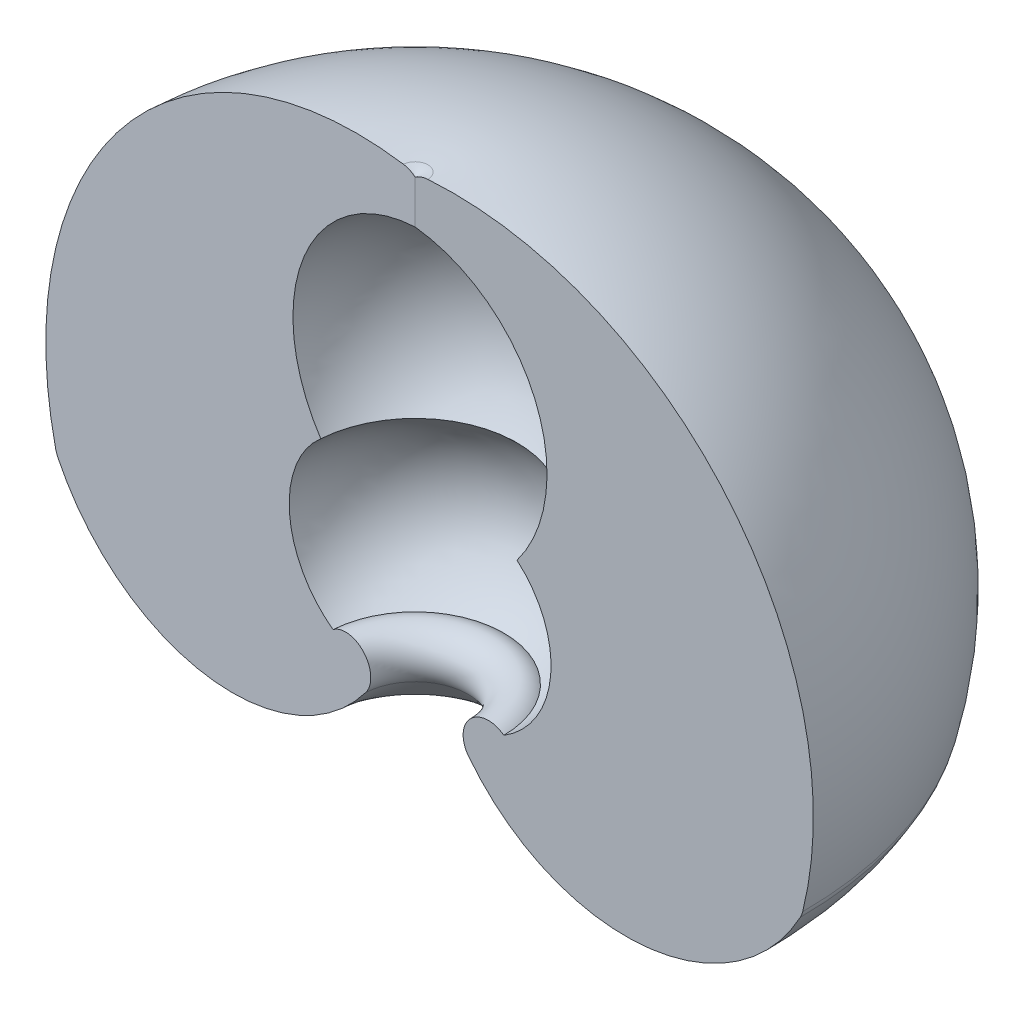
ISO-10303-21;
HEADER;
FILE_DESCRIPTION(('STEP AP214'),'2;1');
FILE_NAME('part.step','',(''),(''),'','','');
FILE_SCHEMA(('AUTOMOTIVE_DESIGN { 1 0 10303 214 1 1 1 1 }'));
ENDSEC;
DATA;
#1=APPLICATION_CONTEXT('core data for automotive mechanical design processes');
#2=APPLICATION_PROTOCOL_DEFINITION('international standard','automotive_design',2000,#1);
#3=PRODUCT_CONTEXT('',#1,'mechanical');
#4=PRODUCT('Part','Part','',(#3));
#5=PRODUCT_RELATED_PRODUCT_CATEGORY('part','',(#4));
#6=PRODUCT_DEFINITION_FORMATION('','',#4);
#7=PRODUCT_DEFINITION_CONTEXT('part definition',#1,'design');
#8=PRODUCT_DEFINITION('design','',#6,#7);
#9=PRODUCT_DEFINITION_SHAPE('','',#8);
#10=(LENGTH_UNIT() NAMED_UNIT(*) SI_UNIT(.MILLI.,.METRE.));
#11=(NAMED_UNIT(*) PLANE_ANGLE_UNIT() SI_UNIT($,.RADIAN.));
#12=(NAMED_UNIT(*) SI_UNIT($,.STERADIAN.) SOLID_ANGLE_UNIT());
#13=UNCERTAINTY_MEASURE_WITH_UNIT(LENGTH_MEASURE(1.E-05),#10,'distance_accuracy_value','');
#14=(GEOMETRIC_REPRESENTATION_CONTEXT(3) GLOBAL_UNCERTAINTY_ASSIGNED_CONTEXT((#13)) GLOBAL_UNIT_ASSIGNED_CONTEXT((#10,
#11,#12)) REPRESENTATION_CONTEXT('',''));
#15=CARTESIAN_POINT('',(0.,0.,0.));
#16=DIRECTION('',(0.,0.,1.));
#17=DIRECTION('',(1.,0.,0.));
#18=AXIS2_PLACEMENT_3D('',#15,#16,#17);
#19=CARTESIAN_POINT('',(0.,244.354444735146,0.));
#20=DIRECTION('',(0.,-1.,0.));
#21=DIRECTION('',(0.,0.,-1.));
#22=AXIS2_PLACEMENT_3D('',#19,#20,#21);
#23=TOROIDAL_SURFACE('',#22,1049.18045326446,73.1000000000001);
#24=CARTESIAN_POINT('',(0.,226.653460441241,0.));
#25=DIRECTION('',(0.,-1.,0.));
#26=DIRECTION('',(0.,0.,-1.));
#27=AXIS2_PLACEMENT_3D('',#24,#25,#26);
#28=CIRCLE('',#27,1120.10495647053);
#29=CARTESIAN_POINT('',(-1117.37643709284,226.653460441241,-78.1345719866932));
#30=VERTEX_POINT('',#29);
#31=CARTESIAN_POINT('',(1120.10495647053,226.653460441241,0.));
#32=VERTEX_POINT('',#31);
#33=EDGE_CURVE('E11',#30,#32,#28,.T.);
#34=ORIENTED_EDGE('',*,*,#33,.T.);
#35=CARTESIAN_POINT('',(1049.18045326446,244.354444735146,0.));
#36=DIRECTION('',(0.,0.,1.));
#37=DIRECTION('',(1.,0.,0.));
#38=AXIS2_PLACEMENT_3D('',#35,#36,#37);
#39=CIRCLE('',#38,73.1000000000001);
#40=CARTESIAN_POINT('',(1113.42198420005,209.474139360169,0.));
#41=VERTEX_POINT('',#40);
#42=EDGE_CURVE('E91',#41,#32,#39,.T.);
#43=ORIENTED_EDGE('',*,*,#42,.F.);
#44=CARTESIAN_POINT('',(0.,209.474139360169,0.));
#45=DIRECTION('',(0.,-1.,0.));
#46=DIRECTION('',(0.,0.,-1.));
#47=AXIS2_PLACEMENT_3D('',#44,#45,#46);
#48=CIRCLE('',#47,1113.42198420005);
#49=CARTESIAN_POINT('',(-1110.70974420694,209.474139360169,-77.6683914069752));
#50=VERTEX_POINT('',#49);
#51=EDGE_CURVE('E48',#50,#41,#48,.T.);
#52=ORIENTED_EDGE('',*,*,#51,.F.);
#53=CARTESIAN_POINT('',(-1046.62470241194,244.354444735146,-73.1871287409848));
#54=DIRECTION('',(0.0697564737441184,0.,-0.997564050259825));
#55=DIRECTION('',(-0.997564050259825,0.,-0.0697564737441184));
#56=AXIS2_PLACEMENT_3D('',#53,#54,#55);
#57=CIRCLE('',#56,73.1000000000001);
#58=EDGE_CURVE('E93',#50,#30,#57,.T.);
#59=ORIENTED_EDGE('',*,*,#58,.T.);
#60=EDGE_LOOP('',(#34,#43,#52,#59));
#61=FACE_BOUND('',#60,.T.);
#62=ADVANCED_FACE('F33',(#61),#23,.T.);
#63=CARTESIAN_POINT('',(0.,479.,0.));
#64=DIRECTION('',(0.,-1.,0.));
#65=DIRECTION('',(0.,0.,-1.));
#66=AXIS2_PLACEMENT_3D('',#63,#64,#65);
#67=DEGENERATE_TOROIDAL_SURFACE('',#66,109.,1042.1189994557,.T.);
#68=CARTESIAN_POINT('',(0.,1518.59732670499,0.));
#69=DIRECTION('',(0.,-1.,0.));
#70=DIRECTION('',(0.,0.,-1.));
#71=AXIS2_PLACEMENT_3D('',#68,#69,#70);
#72=CIRCLE('',#71,36.5472061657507);
#73=CARTESIAN_POINT('',(-36.4581790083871,1518.59732670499,-2.54940422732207));
#74=VERTEX_POINT('',#73);
#75=CARTESIAN_POINT('',(36.5472061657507,1518.59732670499,0.));
#76=VERTEX_POINT('',#75);
#77=EDGE_CURVE('E41',#74,#76,#72,.T.);
#78=ORIENTED_EDGE('',*,*,#77,.T.);
#79=CARTESIAN_POINT('',(109.,479.,0.));
#80=DIRECTION('',(0.,0.,1.));
#81=DIRECTION('',(1.,0.,0.));
#82=AXIS2_PLACEMENT_3D('',#79,#80,#81);
#83=CIRCLE('',#82,1042.1189994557);
#84=EDGE_CURVE('E102',#32,#76,#83,.T.);
#85=ORIENTED_EDGE('',*,*,#84,.F.);
#86=ORIENTED_EDGE('',*,*,#33,.F.);
#87=CARTESIAN_POINT('',(-108.734481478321,479.,-7.60345563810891));
#88=DIRECTION('',(0.0697564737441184,0.,-0.997564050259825));
#89=DIRECTION('',(-0.997564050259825,0.,-0.0697564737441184));
#90=AXIS2_PLACEMENT_3D('',#87,#88,#89);
#91=CIRCLE('',#90,1042.1189994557);
#92=EDGE_CURVE('E121',#30,#74,#91,.T.);
#93=ORIENTED_EDGE('',*,*,#92,.T.);
#94=EDGE_LOOP('',(#78,#85,#86,#93));
#95=FACE_BOUND('',#94,.T.);
#96=ADVANCED_FACE('F35',(#95),#67,.T.);
#97=CARTESIAN_POINT('',(0.,1445.67421080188,-41.6294465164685));
#98=DIRECTION('',(-1.,0.,0.));
#99=DIRECTION('',(0.,0.,-1.));
#100=AXIS2_PLACEMENT_3D('',#97,#98,#99);
#101=CIRCLE('',#100,73.0999999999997);
#102=TRIMMED_CURVE('',#101,(PARAMETER_VALUE(-2.17667707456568)),
(PARAMETER_VALUE(2.17667707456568)),.T.,.PARAMETER.);
#103=CARTESIAN_POINT('',(0.,1445.67421080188,0.));
#104=DIRECTION('',(0.,-1.,0.));
#105=AXIS1_PLACEMENT('',#103,#104);
#106=SURFACE_OF_REVOLUTION('',#102,#105);
#107=CARTESIAN_POINT('',(41.6294465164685,1445.67421080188,0.));
#108=DIRECTION('',(0.,0.,1.));
#109=DIRECTION('',(1.,0.,0.));
#110=AXIS2_PLACEMENT_3D('',#107,#108,#109);
#111=CIRCLE('',#110,73.0999999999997);
#112=CARTESIAN_POINT('',(0.,1505.76247240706,0.));
#113=VERTEX_POINT('',#112);
#114=EDGE_CURVE('E107',#76,#113,#111,.T.);
#115=ORIENTED_EDGE('',*,*,#114,.F.);
#116=ORIENTED_EDGE('',*,*,#77,.F.);
#117=CARTESIAN_POINT('',(-41.528039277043,1445.67421080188,-2.90392339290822));
#118=DIRECTION('',(0.0697564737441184,0.,-0.997564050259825));
#119=DIRECTION('',(-0.997564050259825,0.,-0.0697564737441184));
#120=AXIS2_PLACEMENT_3D('',#117,#118,#119);
#121=CIRCLE('',#120,73.0999999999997);
#122=EDGE_CURVE('E123',#74,#113,#121,.T.);
#123=ORIENTED_EDGE('',*,*,#122,.T.);
#124=EDGE_LOOP('',(#115,#116,#123));
#125=FACE_BOUND('',#124,.T.);
#126=ADVANCED_FACE('F161',(#125),#106,.T.);
#127=CARTESIAN_POINT('',(0.,953.161827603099,49.6523282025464));
#128=DIRECTION('',(-1.,0.,0.));
#129=DIRECTION('',(0.,0.,-1.));
#130=AXIS2_PLACEMENT_3D('',#127,#128,#129);
#131=CIRCLE('',#130,430.70656551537);
#132=TRIMMED_CURVE('',#131,(PARAMETER_VALUE(-1.45525834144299)),
(PARAMETER_VALUE(1.45525834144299)),.T.,.PARAMETER.);
#133=CARTESIAN_POINT('',(0.,953.161827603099,0.));
#134=DIRECTION('',(0.,-1.,0.));
#135=AXIS1_PLACEMENT('',#133,#134);
#136=SURFACE_OF_REVOLUTION('',#132,#135);
#137=CARTESIAN_POINT('',(0.,693.850224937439,0.));
#138=DIRECTION('',(0.,-1.,0.));
#139=DIRECTION('',(0.,0.,-1.));
#140=AXIS2_PLACEMENT_3D('',#137,#138,#139);
#141=CIRCLE('',#140,294.245386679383);
#142=CARTESIAN_POINT('',(-293.528619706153,693.850224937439,-20.5255205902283));
#143=VERTEX_POINT('',#142);
#144=CARTESIAN_POINT('',(294.245386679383,693.850224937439,0.));
#145=VERTEX_POINT('',#144);
#146=EDGE_CURVE('E143',#143,#145,#141,.T.);
#147=ORIENTED_EDGE('',*,*,#146,.T.);
#148=CARTESIAN_POINT('',(-49.6523282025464,953.161827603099,0.));
#149=DIRECTION('',(0.,0.,-1.));
#150=DIRECTION('',(1.,0.,0.));
#151=AXIS2_PLACEMENT_3D('',#148,#149,#150);
#152=CIRCLE('',#151,430.70656551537);
#153=CARTESIAN_POINT('',(0.,1380.99683304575,0.));
#154=VERTEX_POINT('',#153);
#155=EDGE_CURVE('E109',#154,#145,#152,.T.);
#156=ORIENTED_EDGE('',*,*,#155,.F.);
#157=CARTESIAN_POINT('',(49.5313776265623,953.161827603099,3.46357132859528));
#158=DIRECTION('',(-0.0697564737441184,0.,0.997564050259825));
#159=DIRECTION('',(-0.997564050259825,0.,-0.0697564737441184));
#160=AXIS2_PLACEMENT_3D('',#157,#158,#159);
#161=CIRCLE('',#160,430.70656551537);
#162=EDGE_CURVE('E129',#154,#143,#161,.T.);
#163=ORIENTED_EDGE('',*,*,#162,.T.);
#164=EDGE_LOOP('',(#147,#156,#163));
#165=FACE_BOUND('',#164,.T.);
#166=ADVANCED_FACE('F145',(#165),#136,.F.);
#167=CARTESIAN_POINT('',(0.,479.,0.));
#168=DIRECTION('',(0.,-1.,0.));
#169=DIRECTION('',(0.,0.,-1.));
#170=AXIS2_PLACEMENT_3D('',#167,#168,#169);
#171=DEGENERATE_TOROIDAL_SURFACE('',#170,109.,283.683754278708,.T.);
#172=CARTESIAN_POINT('',(0.,236.428797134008,0.));
#173=DIRECTION('',(0.,-1.,0.));
#174=DIRECTION('',(0.,0.,-1.));
#175=AXIS2_PLACEMENT_3D('',#172,#173,#174);
#176=CIRCLE('',#175,256.090733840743);
#177=CARTESIAN_POINT('',(-255.466909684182,236.428797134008,-17.8639865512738));
#178=VERTEX_POINT('',#177);
#179=CARTESIAN_POINT('',(256.090733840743,236.428797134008,0.));
#180=VERTEX_POINT('',#179);
#181=EDGE_CURVE('E141',#178,#180,#176,.T.);
#182=ORIENTED_EDGE('',*,*,#181,.T.);
#183=CARTESIAN_POINT('',(109.,479.,0.));
#184=DIRECTION('',(0.,0.,-1.));
#185=DIRECTION('',(1.,0.,0.));
#186=AXIS2_PLACEMENT_3D('',#183,#184,#185);
#187=CIRCLE('',#186,283.683754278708);
#188=EDGE_CURVE('E114',#145,#180,#187,.T.);
#189=ORIENTED_EDGE('',*,*,#188,.F.);
#190=ORIENTED_EDGE('',*,*,#146,.F.);
#191=CARTESIAN_POINT('',(-108.734481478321,479.,-7.60345563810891));
#192=DIRECTION('',(-0.0697564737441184,0.,0.997564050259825));
#193=DIRECTION('',(-0.997564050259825,0.,-0.0697564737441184));
#194=AXIS2_PLACEMENT_3D('',#191,#192,#193);
#195=CIRCLE('',#194,283.683754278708);
#196=EDGE_CURVE('E132',#143,#178,#195,.T.);
#197=ORIENTED_EDGE('',*,*,#196,.T.);
#198=EDGE_LOOP('',(#182,#189,#190,#197));
#199=FACE_BOUND('',#198,.T.);
#200=ADVANCED_FACE('F151',(#199),#171,.F.);
#201=CARTESIAN_POINT('',(0.,178.434667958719,0.));
#202=DIRECTION('',(0.,-1.,0.));
#203=DIRECTION('',(0.,0.,-1.));
#204=AXIS2_PLACEMENT_3D('',#201,#202,#203);
#205=TOROIDAL_SURFACE('',#204,211.590273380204,73.0999999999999);
#206=CARTESIAN_POINT('',(0.,133.934207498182,0.));
#207=DIRECTION('',(0.,-1.,0.));
#208=DIRECTION('',(0.,0.,-1.));
#209=AXIS2_PLACEMENT_3D('',#206,#207,#208);
#210=CIRCLE('',#209,153.596144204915);
#211=CARTESIAN_POINT('',(-153.221991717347,133.934207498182,-10.714325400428));
#212=VERTEX_POINT('',#211);
#213=CARTESIAN_POINT('',(153.596144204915,133.934207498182,0.));
#214=VERTEX_POINT('',#213);
#215=EDGE_CURVE('E56',#212,#214,#210,.T.);
#216=ORIENTED_EDGE('',*,*,#215,.T.);
#217=CARTESIAN_POINT('',(211.590273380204,178.434667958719,0.));
#218=DIRECTION('',(0.,0.,1.));
#219=DIRECTION('',(1.,0.,0.));
#220=AXIS2_PLACEMENT_3D('',#217,#218,#219);
#221=CIRCLE('',#220,73.0999999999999);
#222=EDGE_CURVE('E117',#180,#214,#221,.T.);
#223=ORIENTED_EDGE('',*,*,#222,.F.);
#224=ORIENTED_EDGE('',*,*,#181,.F.);
#225=CARTESIAN_POINT('',(-211.07485010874,178.434667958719,-14.7597913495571));
#226=DIRECTION('',(0.0697564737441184,0.,-0.997564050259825));
#227=DIRECTION('',(-0.997564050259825,0.,-0.0697564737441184));
#228=AXIS2_PLACEMENT_3D('',#225,#226,#227);
#229=CIRCLE('',#228,73.0999999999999);
#230=EDGE_CURVE('E135',#178,#212,#229,.T.);
#231=ORIENTED_EDGE('',*,*,#230,.T.);
#232=EDGE_LOOP('',(#216,#223,#224,#231));
#233=FACE_BOUND('',#232,.T.);
#234=ADVANCED_FACE('F154',(#233),#205,.T.);
#235=CARTESIAN_POINT('',(0.,483.363267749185,0.));
#236=DIRECTION('',(0.,-1.,0.));
#237=DIRECTION('',(0.,0.,-1.));
#238=AXIS2_PLACEMENT_3D('',#235,#236,#237);
#239=TOROIDAL_SURFACE('',#238,608.980961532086,574.);
#240=CARTESIAN_POINT('',(-607.49751451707,483.363267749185,-42.4803644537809));
#241=DIRECTION('',(0.0697564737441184,0.,-0.997564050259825));
#242=DIRECTION('',(-0.997564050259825,0.,-0.0697564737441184));
#243=AXIS2_PLACEMENT_3D('',#240,#241,#242);
#244=CIRCLE('',#243,574.);
#245=EDGE_CURVE('E137',#212,#50,#244,.T.);
#246=ORIENTED_EDGE('',*,*,#245,.T.);
#247=ORIENTED_EDGE('',*,*,#51,.T.);
#248=CARTESIAN_POINT('',(608.980961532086,483.363267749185,0.));
#249=DIRECTION('',(0.,0.,1.));
#250=DIRECTION('',(1.,0.,0.));
#251=AXIS2_PLACEMENT_3D('',#248,#249,#250);
#252=CIRCLE('',#251,574.);
#253=EDGE_CURVE('E105',#214,#41,#252,.T.);
#254=ORIENTED_EDGE('',*,*,#253,.F.);
#255=ORIENTED_EDGE('',*,*,#215,.F.);
#256=EDGE_LOOP('',(#246,#247,#254,#255));
#257=FACE_BOUND('',#256,.T.);
#258=ADVANCED_FACE('F156',(#257),#239,.T.);
#259=CARTESIAN_POINT('',(-1046.62470241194,244.354444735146,-73.1871287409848));
#260=DIRECTION('',(0.0697564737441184,0.,-0.997564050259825));
#261=DIRECTION('',(-0.997564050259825,0.,-0.0697564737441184));
#262=AXIS2_PLACEMENT_3D('',#259,#260,#261);
#263=PLANE('',#262);
#264=ORIENTED_EDGE('',*,*,#58,.F.);
#265=ORIENTED_EDGE('',*,*,#245,.F.);
#266=ORIENTED_EDGE('',*,*,#230,.F.);
#267=ORIENTED_EDGE('',*,*,#196,.F.);
#268=ORIENTED_EDGE('',*,*,#162,.F.);
#269=DIRECTION('',(0.,-1.,0.));
#270=VECTOR('',#269,1.);
#271=CARTESIAN_POINT('',(0.,1380.99683304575,0.));
#272=LINE('',#271,#270);
#273=EDGE_CURVE('E126',#113,#154,#272,.T.);
#274=ORIENTED_EDGE('',*,*,#273,.F.);
#275=ORIENTED_EDGE('',*,*,#122,.F.);
#276=ORIENTED_EDGE('',*,*,#92,.F.);
#277=EDGE_LOOP('',(#264,#265,#266,#267,#268,#274,#275,#276));
#278=FACE_BOUND('',#277,.T.);
#279=ADVANCED_FACE('F158',(#278),#263,.F.);
#280=CARTESIAN_POINT('',(1049.18045326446,244.354444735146,0.));
#281=DIRECTION('',(0.,0.,1.));
#282=DIRECTION('',(1.,0.,0.));
#283=AXIS2_PLACEMENT_3D('',#280,#281,#282);
#284=PLANE('',#283);
#285=ORIENTED_EDGE('',*,*,#42,.T.);
#286=ORIENTED_EDGE('',*,*,#84,.T.);
#287=ORIENTED_EDGE('',*,*,#114,.T.);
#288=ORIENTED_EDGE('',*,*,#273,.T.);
#289=ORIENTED_EDGE('',*,*,#155,.T.);
#290=ORIENTED_EDGE('',*,*,#188,.T.);
#291=ORIENTED_EDGE('',*,*,#222,.T.);
#292=ORIENTED_EDGE('',*,*,#253,.T.);
#293=EDGE_LOOP('',(#285,#286,#287,#288,#289,#290,#291,#292));
#294=FACE_BOUND('',#293,.T.);
#295=ADVANCED_FACE('F100',(#294),#284,.T.);
#296=CLOSED_SHELL('',(#62,#96,#126,#166,#200,#234,#258,#279,#295));
#297=MANIFOLD_SOLID_BREP('B2',#296);
#298=ADVANCED_BREP_SHAPE_REPRESENTATION('',(#18,#297),#14);
#299=SHAPE_DEFINITION_REPRESENTATION(#9,#298);
ENDSEC;
END-ISO-10303-21;
